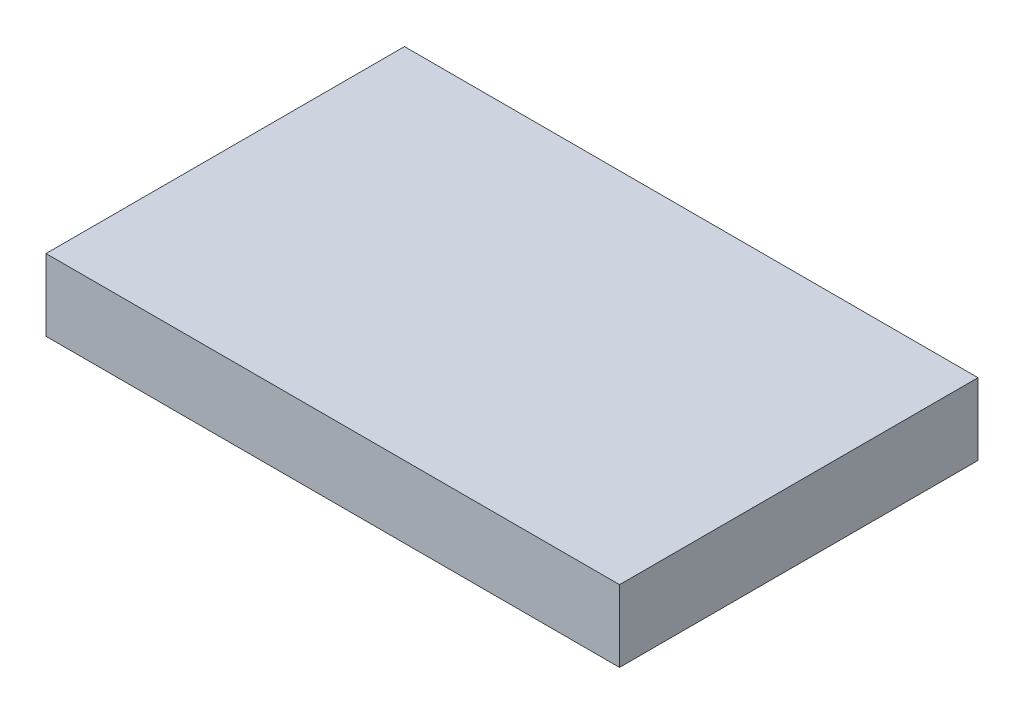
ISO-10303-21;
HEADER;
FILE_DESCRIPTION(('STEP AP214'),'2;1');
FILE_NAME('part.step','',(''),(''),'','','');
FILE_SCHEMA(('AUTOMOTIVE_DESIGN { 1 0 10303 214 1 1 1 1 }'));
ENDSEC;
DATA;
#1=APPLICATION_CONTEXT('core data for automotive mechanical design processes');
#2=APPLICATION_PROTOCOL_DEFINITION('international standard','automotive_design',2000,#1);
#3=PRODUCT_CONTEXT('',#1,'mechanical');
#4=PRODUCT('Part','Part','',(#3));
#5=PRODUCT_RELATED_PRODUCT_CATEGORY('part','',(#4));
#6=PRODUCT_DEFINITION_FORMATION('','',#4);
#7=PRODUCT_DEFINITION_CONTEXT('part definition',#1,'design');
#8=PRODUCT_DEFINITION('design','',#6,#7);
#9=PRODUCT_DEFINITION_SHAPE('','',#8);
#10=(LENGTH_UNIT() NAMED_UNIT(*) SI_UNIT(.MILLI.,.METRE.));
#11=(NAMED_UNIT(*) PLANE_ANGLE_UNIT() SI_UNIT($,.RADIAN.));
#12=(NAMED_UNIT(*) SI_UNIT($,.STERADIAN.) SOLID_ANGLE_UNIT());
#13=UNCERTAINTY_MEASURE_WITH_UNIT(LENGTH_MEASURE(1.E-05),#10,'distance_accuracy_value','');
#14=(GEOMETRIC_REPRESENTATION_CONTEXT(3) GLOBAL_UNCERTAINTY_ASSIGNED_CONTEXT((#13)) GLOBAL_UNIT_ASSIGNED_CONTEXT((#10,
#11,#12)) REPRESENTATION_CONTEXT('',''));
#15=CARTESIAN_POINT('',(0.,0.,0.));
#16=DIRECTION('',(0.,0.,1.));
#17=DIRECTION('',(1.,0.,0.));
#18=AXIS2_PLACEMENT_3D('',#15,#16,#17);
#19=CARTESIAN_POINT('',(-60.,15.,-37.5));
#20=DIRECTION('',(1.,0.,0.));
#21=DIRECTION('',(0.,0.,-1.));
#22=AXIS2_PLACEMENT_3D('',#19,#20,#21);
#23=PLANE('',#22);
#24=DIRECTION('',(0.,0.,1.));
#25=VECTOR('',#24,1.);
#26=CARTESIAN_POINT('',(-60.,0.,-37.5));
#27=LINE('',#26,#25);
#28=CARTESIAN_POINT('',(-60.,0.,-37.5));
#29=VERTEX_POINT('',#28);
#30=CARTESIAN_POINT('',(-60.,0.,37.5));
#31=VERTEX_POINT('',#30);
#32=EDGE_CURVE('E97',#29,#31,#27,.T.);
#33=ORIENTED_EDGE('',*,*,#32,.T.);
#34=DIRECTION('',(0.,-1.,0.));
#35=VECTOR('',#34,1.);
#36=CARTESIAN_POINT('',(-60.,15.,37.5));
#37=LINE('',#36,#35);
#38=CARTESIAN_POINT('',(-60.,15.,37.5));
#39=VERTEX_POINT('',#38);
#40=EDGE_CURVE('E11',#39,#31,#37,.T.);
#41=ORIENTED_EDGE('',*,*,#40,.F.);
#42=DIRECTION('',(0.,0.,1.));
#43=VECTOR('',#42,1.);
#44=CARTESIAN_POINT('',(-60.,15.,-37.5));
#45=LINE('',#44,#43);
#46=CARTESIAN_POINT('',(-60.,15.,-37.5));
#47=VERTEX_POINT('',#46);
#48=EDGE_CURVE('E85',#47,#39,#45,.T.);
#49=ORIENTED_EDGE('',*,*,#48,.F.);
#50=DIRECTION('',(0.,-1.,0.));
#51=VECTOR('',#50,1.);
#52=CARTESIAN_POINT('',(-60.,15.,-37.5));
#53=LINE('',#52,#51);
#54=EDGE_CURVE('E93',#47,#29,#53,.T.);
#55=ORIENTED_EDGE('',*,*,#54,.T.);
#56=EDGE_LOOP('',(#33,#41,#49,#55));
#57=FACE_BOUND('',#56,.T.);
#58=ADVANCED_FACE('F34',(#57),#23,.F.);
#59=CARTESIAN_POINT('',(-60.,15.,37.5));
#60=DIRECTION('',(0.,0.,-1.));
#61=DIRECTION('',(-1.,0.,0.));
#62=AXIS2_PLACEMENT_3D('',#59,#60,#61);
#63=PLANE('',#62);
#64=DIRECTION('',(1.,0.,0.));
#65=VECTOR('',#64,1.);
#66=CARTESIAN_POINT('',(-60.,0.,37.5));
#67=LINE('',#66,#65);
#68=CARTESIAN_POINT('',(60.,0.,37.5));
#69=VERTEX_POINT('',#68);
#70=EDGE_CURVE('E89',#31,#69,#67,.T.);
#71=ORIENTED_EDGE('',*,*,#70,.T.);
#72=DIRECTION('',(0.,-1.,0.));
#73=VECTOR('',#72,1.);
#74=CARTESIAN_POINT('',(60.,15.,37.5));
#75=LINE('',#74,#73);
#76=CARTESIAN_POINT('',(60.,15.,37.5));
#77=VERTEX_POINT('',#76);
#78=EDGE_CURVE('E42',#77,#69,#75,.T.);
#79=ORIENTED_EDGE('',*,*,#78,.F.);
#80=DIRECTION('',(1.,0.,0.));
#81=VECTOR('',#80,1.);
#82=CARTESIAN_POINT('',(-60.,15.,37.5));
#83=LINE('',#82,#81);
#84=EDGE_CURVE('E80',#39,#77,#83,.T.);
#85=ORIENTED_EDGE('',*,*,#84,.F.);
#86=ORIENTED_EDGE('',*,*,#40,.T.);
#87=EDGE_LOOP('',(#71,#79,#85,#86));
#88=FACE_BOUND('',#87,.T.);
#89=ADVANCED_FACE('F88',(#88),#63,.F.);
#90=CARTESIAN_POINT('',(60.,15.,-37.5));
#91=DIRECTION('',(-1.,0.,0.));
#92=DIRECTION('',(0.,0.,1.));
#93=AXIS2_PLACEMENT_3D('',#90,#91,#92);
#94=PLANE('',#93);
#95=DIRECTION('',(0.,0.,-1.));
#96=VECTOR('',#95,1.);
#97=CARTESIAN_POINT('',(60.,0.,-37.5));
#98=LINE('',#97,#96);
#99=CARTESIAN_POINT('',(60.,0.,-37.5));
#100=VERTEX_POINT('',#99);
#101=EDGE_CURVE('E67',#69,#100,#98,.T.);
#102=ORIENTED_EDGE('',*,*,#101,.T.);
#103=DIRECTION('',(0.,-1.,0.));
#104=VECTOR('',#103,1.);
#105=CARTESIAN_POINT('',(60.,15.,-37.5));
#106=LINE('',#105,#104);
#107=CARTESIAN_POINT('',(60.,15.,-37.5));
#108=VERTEX_POINT('',#107);
#109=EDGE_CURVE('E90',#108,#100,#106,.T.);
#110=ORIENTED_EDGE('',*,*,#109,.F.);
#111=DIRECTION('',(0.,0.,-1.));
#112=VECTOR('',#111,1.);
#113=CARTESIAN_POINT('',(60.,15.,-37.5));
#114=LINE('',#113,#112);
#115=EDGE_CURVE('E83',#77,#108,#114,.T.);
#116=ORIENTED_EDGE('',*,*,#115,.F.);
#117=ORIENTED_EDGE('',*,*,#78,.T.);
#118=EDGE_LOOP('',(#102,#110,#116,#117));
#119=FACE_BOUND('',#118,.T.);
#120=ADVANCED_FACE('F91',(#119),#94,.F.);
#121=CARTESIAN_POINT('',(-60.,15.,-37.5));
#122=DIRECTION('',(0.,0.,1.));
#123=DIRECTION('',(1.,0.,0.));
#124=AXIS2_PLACEMENT_3D('',#121,#122,#123);
#125=PLANE('',#124);
#126=DIRECTION('',(-1.,0.,0.));
#127=VECTOR('',#126,1.);
#128=CARTESIAN_POINT('',(-60.,0.,-37.5));
#129=LINE('',#128,#127);
#130=EDGE_CURVE('E73',#100,#29,#129,.T.);
#131=ORIENTED_EDGE('',*,*,#130,.T.);
#132=ORIENTED_EDGE('',*,*,#54,.F.);
#133=DIRECTION('',(-1.,0.,0.));
#134=VECTOR('',#133,1.);
#135=CARTESIAN_POINT('',(-60.,15.,-37.5));
#136=LINE('',#135,#134);
#137=EDGE_CURVE('E50',#108,#47,#136,.T.);
#138=ORIENTED_EDGE('',*,*,#137,.F.);
#139=ORIENTED_EDGE('',*,*,#109,.T.);
#140=EDGE_LOOP('',(#131,#132,#138,#139));
#141=FACE_BOUND('',#140,.T.);
#142=ADVANCED_FACE('F104',(#141),#125,.F.);
#143=CARTESIAN_POINT('',(-60.,15.,37.5));
#144=DIRECTION('',(0.,1.,0.));
#145=DIRECTION('',(0.,0.,1.));
#146=AXIS2_PLACEMENT_3D('',#143,#144,#145);
#147=PLANE('',#146);
#148=ORIENTED_EDGE('',*,*,#48,.T.);
#149=ORIENTED_EDGE('',*,*,#84,.T.);
#150=ORIENTED_EDGE('',*,*,#115,.T.);
#151=ORIENTED_EDGE('',*,*,#137,.T.);
#152=EDGE_LOOP('',(#148,#149,#150,#151));
#153=FACE_BOUND('',#152,.T.);
#154=ADVANCED_FACE('F81',(#153),#147,.T.);
#155=CARTESIAN_POINT('',(-60.,0.,37.5));
#156=DIRECTION('',(0.,1.,0.));
#157=DIRECTION('',(0.,0.,1.));
#158=AXIS2_PLACEMENT_3D('',#155,#156,#157);
#159=PLANE('',#158);
#160=ORIENTED_EDGE('',*,*,#32,.F.);
#161=ORIENTED_EDGE('',*,*,#130,.F.);
#162=ORIENTED_EDGE('',*,*,#101,.F.);
#163=ORIENTED_EDGE('',*,*,#70,.F.);
#164=EDGE_LOOP('',(#160,#161,#162,#163));
#165=FACE_BOUND('',#164,.T.);
#166=ADVANCED_FACE('F107',(#165),#159,.F.);
#167=CLOSED_SHELL('',(#58,#89,#120,#142,#154,#166));
#168=MANIFOLD_SOLID_BREP('B2',#167);
#169=ADVANCED_BREP_SHAPE_REPRESENTATION('',(#18,#168),#14);
#170=SHAPE_DEFINITION_REPRESENTATION(#9,#169);
ENDSEC;
END-ISO-10303-21;
